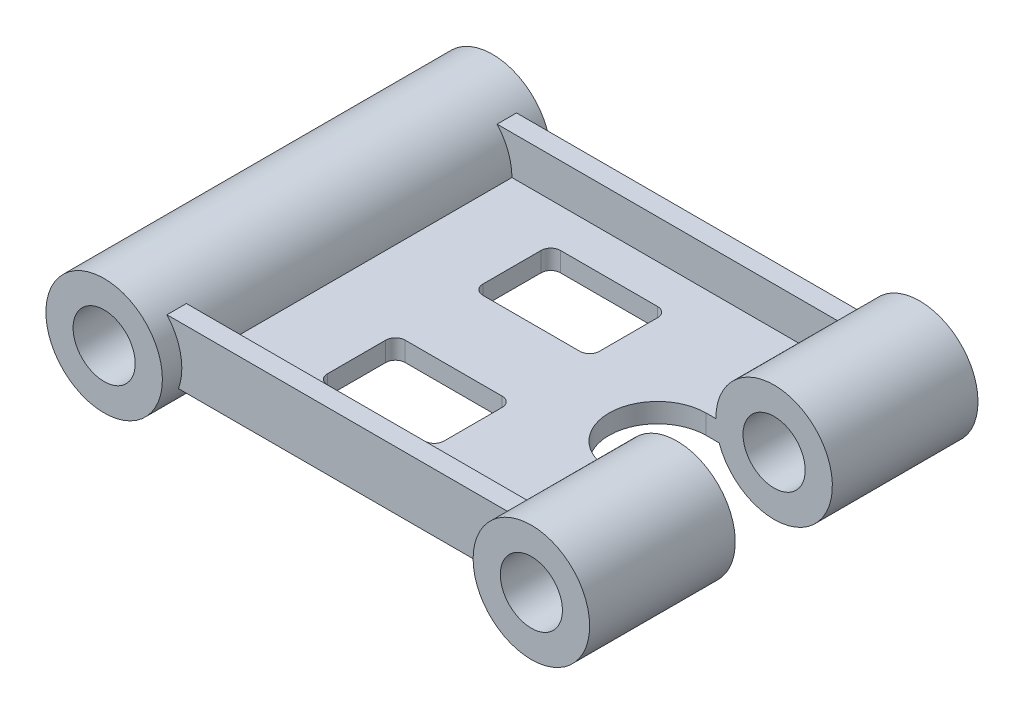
from build123d import *

# Parameters (mm, degrees)
SKETCH_1_R          = 30
EXTRUDE_1_DEPTH     = 100
EXTRUDE_1_2_DEPTH   = 100
EXTRUDE_2_DEPTH     = 90
SKETCH_3_R          = 16
CUT_EXTRUDE_1_DEPTH = 322.558703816
EXTRUDE_3_DEPTH     = 10
CUT_EXTRUDE_2_DEPTH = 276.862284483
SKETCH_6_W          = 60
SKETCH_6_H          = 40
CUT_EXTRUDE_3_DEPTH = 271.924343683
FILLET_1_R          = 5


with BuildPart() as part:
    # Sketch 1 → Extrude 1 (new, symmetric)
    with BuildSketch(Plane.XY):
        Circle(SKETCH_1_R)
    extrude(amount=EXTRUDE_1_DEPTH, both=True)



with BuildPart() as body_2:
    # Sketch 1 → Extrude 1 2 (new, symmetric)
    with BuildSketch(Plane.XY):
        with Locations((220, 0)):
            Circle(SKETCH_1_R)
    extrude(amount=EXTRUDE_1_2_DEPTH, both=True)


with BuildPart() as part_1:
    add(part.part)

    add(body_2.part)  # Extrude 2 merges body 2
    # Sketch 2 → Extrude 2 (add, symmetric)
    with BuildSketch(Plane.XY):
        with BuildLine():
            Line((30, 0), (190, 0))
            ThreePointArc((190, 0), (190.43204321, -5.073059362), (191.715728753, -10))
            Line((191.715728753, -10), (28.284271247, -10))
            ThreePointArc((28.284271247, -10), (29.56795679, -5.073059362), (30, 0))
        make_face()
    extrude(amount=EXTRUDE_2_DEPTH, both=True)

    # Sketch 3 → Cut-Extrude 1 (cut, through all)
    with BuildSketch(Plane.XY.offset(100)):
        Circle(SKETCH_3_R)
        with Locations((220, 0)):
            Circle(SKETCH_3_R)
    extrude(amount=-CUT_EXTRUDE_1_DEPTH, mode=Mode.SUBTRACT)

    # Sketch 4 → Extrude 3 (add)
    with BuildSketch(Plane.XY.offset(90)):
        with BuildLine():
            Line((22.360679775, 20), (197.639320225, 20))
            ThreePointArc((197.639320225, 20), (191.974829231, 10.704662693), (190, 0))
            Line((190, 0), (30, 0))
            ThreePointArc((30, 0), (28.025170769, 10.704662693), (22.360679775, 20))
        make_face()
    extrude_3 = extrude(amount=-EXTRUDE_3_DEPTH)

    # Mirror 1: Extrude 3 across plane
    add(extrude_3.mirror(Plane.XY))

    # Sketch 5 → Cut-Extrude 2 (cut, through all)
    with BuildSketch(Plane(origin=(0, 30, 0), x_dir=(-1, 0, 0), z_dir=(0, 1, 0))):
        with BuildLine():
            Line((-286.048689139, 25), (-185, 25))
            ThreePointArc((-185, 25), (-160, 0), (-185, -25))
            Line((-185, -25), (-286.048689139, -25))
            Line((-286.048689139, -25), (-286.048689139, 25))
        make_face()
    extrude(amount=-CUT_EXTRUDE_2_DEPTH, mode=Mode.SUBTRACT)

    # Sketch 6 → Cut-Extrude 3 (cut, through all)
    with BuildSketch(Plane(origin=(0, 0, 0), x_dir=(-1, 0, 0), z_dir=(0, 1, 0))):
        with Locations((-100, -40)):
            Rectangle(SKETCH_6_W, SKETCH_6_H)
        with Locations((-100, 40)):
            Rectangle(SKETCH_6_W, SKETCH_6_H)
    extrude(amount=-CUT_EXTRUDE_3_DEPTH, mode=Mode.SUBTRACT)

    # Fillet 1
    fillet_1_edges = [part_1.edges().sort_by_distance(p)[0] for p in [
        (130, -5, 20),
        (130, -5, 60),
        (70, -5, 60),
        (70, -5, 20),
        (130, -5, -60),
        (130, -5, -20),
        (70, -5, -20),
        (70, -5, -60),
    ]]
    fillet(fillet_1_edges, radius=FILLET_1_R)


solid = part_1.part
